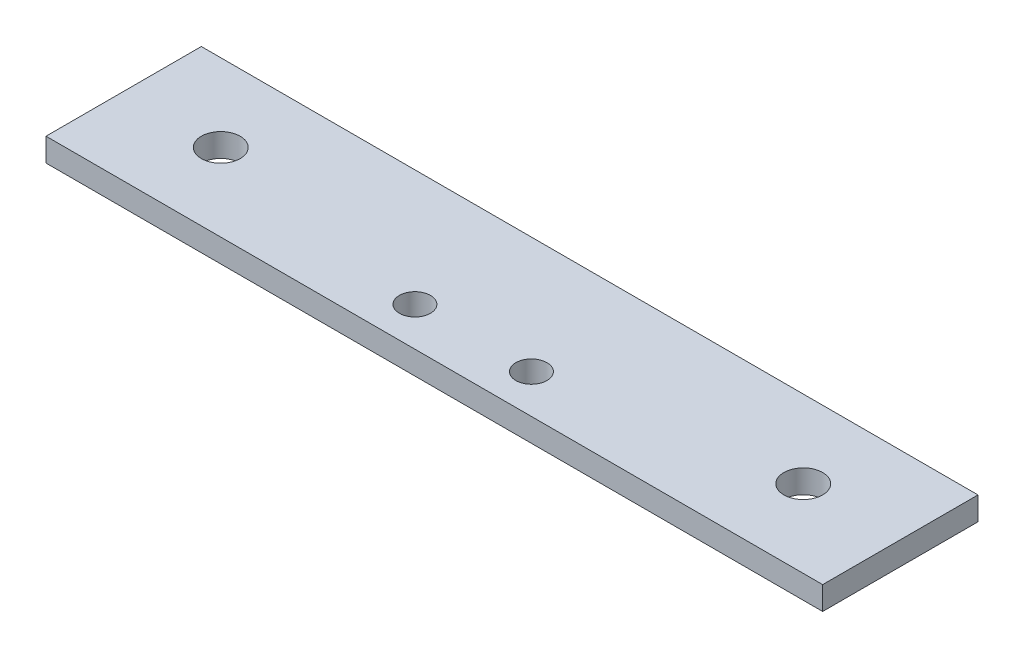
ISO-10303-21;
HEADER;
FILE_DESCRIPTION(('STEP AP214'),'2;1');
FILE_NAME('part.step','',(''),(''),'','','');
FILE_SCHEMA(('AUTOMOTIVE_DESIGN { 1 0 10303 214 1 1 1 1 }'));
ENDSEC;
DATA;
#1=APPLICATION_CONTEXT('core data for automotive mechanical design processes');
#2=APPLICATION_PROTOCOL_DEFINITION('international standard','automotive_design',2000,#1);
#3=PRODUCT_CONTEXT('',#1,'mechanical');
#4=PRODUCT('Part','Part','',(#3));
#5=PRODUCT_RELATED_PRODUCT_CATEGORY('part','',(#4));
#6=PRODUCT_DEFINITION_FORMATION('','',#4);
#7=PRODUCT_DEFINITION_CONTEXT('part definition',#1,'design');
#8=PRODUCT_DEFINITION('design','',#6,#7);
#9=PRODUCT_DEFINITION_SHAPE('','',#8);
#10=(LENGTH_UNIT() NAMED_UNIT(*) SI_UNIT(.MILLI.,.METRE.));
#11=(NAMED_UNIT(*) PLANE_ANGLE_UNIT() SI_UNIT($,.RADIAN.));
#12=(NAMED_UNIT(*) SI_UNIT($,.STERADIAN.) SOLID_ANGLE_UNIT());
#13=UNCERTAINTY_MEASURE_WITH_UNIT(LENGTH_MEASURE(1.E-05),#10,'distance_accuracy_value','');
#14=(GEOMETRIC_REPRESENTATION_CONTEXT(3) GLOBAL_UNCERTAINTY_ASSIGNED_CONTEXT((#13)) GLOBAL_UNIT_ASSIGNED_CONTEXT((#10,
#11,#12)) REPRESENTATION_CONTEXT('',''));
#15=CARTESIAN_POINT('',(0.,0.,0.));
#16=DIRECTION('',(0.,0.,1.));
#17=DIRECTION('',(1.,0.,0.));
#18=AXIS2_PLACEMENT_3D('',#15,#16,#17);
#19=CARTESIAN_POINT('',(0.,3.,0.));
#20=DIRECTION('',(0.,1.,0.));
#21=DIRECTION('',(0.,0.,1.));
#22=AXIS2_PLACEMENT_3D('',#19,#20,#21);
#23=PLANE('',#22);
#24=CARTESIAN_POINT('',(-7.50000000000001,3.,5.));
#25=DIRECTION('',(0.,1.,0.));
#26=DIRECTION('',(0.,0.,1.));
#27=AXIS2_PLACEMENT_3D('',#24,#25,#26);
#28=CIRCLE('',#27,2.);
#29=CARTESIAN_POINT('',(-7.50000000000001,3.,7.));
#30=VERTEX_POINT('',#29);
#31=EDGE_CURVE('E142',#30,#30,#28,.T.);
#32=ORIENTED_EDGE('',*,*,#31,.F.);
#33=EDGE_LOOP('',(#32));
#34=FACE_BOUND('',#33,.T.);
#35=CARTESIAN_POINT('',(-37.5,3.,0.));
#36=DIRECTION('',(0.,1.,0.));
#37=DIRECTION('',(0.,0.,1.));
#38=AXIS2_PLACEMENT_3D('',#35,#36,#37);
#39=CIRCLE('',#38,2.5);
#40=CARTESIAN_POINT('',(-37.5,3.,2.5));
#41=VERTEX_POINT('',#40);
#42=EDGE_CURVE('E112',#41,#41,#39,.T.);
#43=ORIENTED_EDGE('',*,*,#42,.F.);
#44=EDGE_LOOP('',(#43));
#45=FACE_BOUND('',#44,.T.);
#46=DIRECTION('',(0.,0.,-1.));
#47=VECTOR('',#46,1.);
#48=CARTESIAN_POINT('',(50.,3.,-10.));
#49=LINE('',#48,#47);
#50=CARTESIAN_POINT('',(50.,3.,10.));
#51=VERTEX_POINT('',#50);
#52=CARTESIAN_POINT('',(50.,3.,-10.));
#53=VERTEX_POINT('',#52);
#54=EDGE_CURVE('E92',#51,#53,#49,.T.);
#55=ORIENTED_EDGE('',*,*,#54,.T.);
#56=DIRECTION('',(-1.,0.,0.));
#57=VECTOR('',#56,1.);
#58=CARTESIAN_POINT('',(-50.,3.,-10.));
#59=LINE('',#58,#57);
#60=CARTESIAN_POINT('',(-50.,3.,-10.));
#61=VERTEX_POINT('',#60);
#62=EDGE_CURVE('E87',#53,#61,#59,.T.);
#63=ORIENTED_EDGE('',*,*,#62,.T.);
#64=DIRECTION('',(0.,0.,1.));
#65=VECTOR('',#64,1.);
#66=CARTESIAN_POINT('',(-50.,3.,-10.));
#67=LINE('',#66,#65);
#68=CARTESIAN_POINT('',(-50.,3.,10.));
#69=VERTEX_POINT('',#68);
#70=EDGE_CURVE('E90',#61,#69,#67,.T.);
#71=ORIENTED_EDGE('',*,*,#70,.T.);
#72=DIRECTION('',(1.,0.,0.));
#73=VECTOR('',#72,1.);
#74=CARTESIAN_POINT('',(-50.,3.,10.));
#75=LINE('',#74,#73);
#76=EDGE_CURVE('E57',#69,#51,#75,.T.);
#77=ORIENTED_EDGE('',*,*,#76,.T.);
#78=EDGE_LOOP('',(#55,#63,#71,#77));
#79=FACE_BOUND('',#78,.T.);
#80=CARTESIAN_POINT('',(37.5,3.,0.));
#81=DIRECTION('',(0.,1.,0.));
#82=DIRECTION('',(0.,0.,1.));
#83=AXIS2_PLACEMENT_3D('',#80,#81,#82);
#84=CIRCLE('',#83,2.5);
#85=CARTESIAN_POINT('',(37.5,3.,2.49999999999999));
#86=VERTEX_POINT('',#85);
#87=EDGE_CURVE('E134',#86,#86,#84,.T.);
#88=ORIENTED_EDGE('',*,*,#87,.F.);
#89=EDGE_LOOP('',(#88));
#90=FACE_BOUND('',#89,.T.);
#91=CARTESIAN_POINT('',(7.49999999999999,3.,5.));
#92=DIRECTION('',(0.,1.,0.));
#93=DIRECTION('',(0.,0.,1.));
#94=AXIS2_PLACEMENT_3D('',#91,#92,#93);
#95=CIRCLE('',#94,2.);
#96=CARTESIAN_POINT('',(7.49999999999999,3.,7.));
#97=VERTEX_POINT('',#96);
#98=EDGE_CURVE('E150',#97,#97,#95,.T.);
#99=ORIENTED_EDGE('',*,*,#98,.F.);
#100=EDGE_LOOP('',(#99));
#101=FACE_BOUND('',#100,.T.);
#102=ADVANCED_FACE('F39',(#34,#45,#79,#90,#101),#23,.T.);
#103=CARTESIAN_POINT('',(0.,0.,0.));
#104=DIRECTION('',(0.,1.,0.));
#105=DIRECTION('',(0.,0.,1.));
#106=AXIS2_PLACEMENT_3D('',#103,#104,#105);
#107=PLANE('',#106);
#108=DIRECTION('',(0.,0.,-1.));
#109=VECTOR('',#108,1.);
#110=CARTESIAN_POINT('',(50.,0.,-10.));
#111=LINE('',#110,#109);
#112=CARTESIAN_POINT('',(50.,0.,10.));
#113=VERTEX_POINT('',#112);
#114=CARTESIAN_POINT('',(50.,0.,-10.));
#115=VERTEX_POINT('',#114);
#116=EDGE_CURVE('E108',#113,#115,#111,.T.);
#117=ORIENTED_EDGE('',*,*,#116,.F.);
#118=DIRECTION('',(1.,0.,0.));
#119=VECTOR('',#118,1.);
#120=CARTESIAN_POINT('',(-50.,0.,10.));
#121=LINE('',#120,#119);
#122=CARTESIAN_POINT('',(-50.,0.,10.));
#123=VERTEX_POINT('',#122);
#124=EDGE_CURVE('E80',#123,#113,#121,.T.);
#125=ORIENTED_EDGE('',*,*,#124,.F.);
#126=DIRECTION('',(0.,0.,1.));
#127=VECTOR('',#126,1.);
#128=CARTESIAN_POINT('',(-50.,0.,-10.));
#129=LINE('',#128,#127);
#130=CARTESIAN_POINT('',(-50.,0.,-10.));
#131=VERTEX_POINT('',#130);
#132=EDGE_CURVE('E74',#131,#123,#129,.T.);
#133=ORIENTED_EDGE('',*,*,#132,.F.);
#134=DIRECTION('',(-1.,0.,0.));
#135=VECTOR('',#134,1.);
#136=CARTESIAN_POINT('',(-50.,0.,-10.));
#137=LINE('',#136,#135);
#138=EDGE_CURVE('E97',#115,#131,#137,.T.);
#139=ORIENTED_EDGE('',*,*,#138,.F.);
#140=EDGE_LOOP('',(#117,#125,#133,#139));
#141=FACE_BOUND('',#140,.T.);
#142=CARTESIAN_POINT('',(-37.5,0.,0.));
#143=DIRECTION('',(0.,1.,0.));
#144=DIRECTION('',(0.,0.,1.));
#145=AXIS2_PLACEMENT_3D('',#142,#143,#144);
#146=CIRCLE('',#145,2.5);
#147=CARTESIAN_POINT('',(-37.5,0.,2.5));
#148=VERTEX_POINT('',#147);
#149=EDGE_CURVE('E130',#148,#148,#146,.T.);
#150=ORIENTED_EDGE('',*,*,#149,.T.);
#151=EDGE_LOOP('',(#150));
#152=FACE_BOUND('',#151,.T.);
#153=CARTESIAN_POINT('',(37.5,0.,0.));
#154=DIRECTION('',(0.,1.,0.));
#155=DIRECTION('',(0.,0.,1.));
#156=AXIS2_PLACEMENT_3D('',#153,#154,#155);
#157=CIRCLE('',#156,2.5);
#158=CARTESIAN_POINT('',(37.5,0.,2.49999999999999));
#159=VERTEX_POINT('',#158);
#160=EDGE_CURVE('E138',#159,#159,#157,.T.);
#161=ORIENTED_EDGE('',*,*,#160,.T.);
#162=EDGE_LOOP('',(#161));
#163=FACE_BOUND('',#162,.T.);
#164=CARTESIAN_POINT('',(-7.50000000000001,0.,5.));
#165=DIRECTION('',(0.,1.,0.));
#166=DIRECTION('',(0.,0.,1.));
#167=AXIS2_PLACEMENT_3D('',#164,#165,#166);
#168=CIRCLE('',#167,2.);
#169=CARTESIAN_POINT('',(-7.50000000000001,0.,7.));
#170=VERTEX_POINT('',#169);
#171=EDGE_CURVE('E146',#170,#170,#168,.T.);
#172=ORIENTED_EDGE('',*,*,#171,.T.);
#173=EDGE_LOOP('',(#172));
#174=FACE_BOUND('',#173,.T.);
#175=CARTESIAN_POINT('',(7.49999999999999,0.,5.));
#176=DIRECTION('',(0.,1.,0.));
#177=DIRECTION('',(0.,0.,1.));
#178=AXIS2_PLACEMENT_3D('',#175,#176,#177);
#179=CIRCLE('',#178,2.);
#180=CARTESIAN_POINT('',(7.49999999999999,0.,7.));
#181=VERTEX_POINT('',#180);
#182=EDGE_CURVE('E154',#181,#181,#179,.T.);
#183=ORIENTED_EDGE('',*,*,#182,.T.);
#184=EDGE_LOOP('',(#183));
#185=FACE_BOUND('',#184,.T.);
#186=ADVANCED_FACE('F125',(#141,#152,#163,#174,#185),#107,.F.);
#187=CARTESIAN_POINT('',(50.,3.,-10.));
#188=DIRECTION('',(-1.,0.,0.));
#189=DIRECTION('',(0.,0.,1.));
#190=AXIS2_PLACEMENT_3D('',#187,#188,#189);
#191=PLANE('',#190);
#192=ORIENTED_EDGE('',*,*,#116,.T.);
#193=DIRECTION('',(0.,-1.,0.));
#194=VECTOR('',#193,1.);
#195=CARTESIAN_POINT('',(50.,3.,-10.));
#196=LINE('',#195,#194);
#197=EDGE_CURVE('E11',#53,#115,#196,.T.);
#198=ORIENTED_EDGE('',*,*,#197,.F.);
#199=ORIENTED_EDGE('',*,*,#54,.F.);
#200=DIRECTION('',(0.,-1.,0.));
#201=VECTOR('',#200,1.);
#202=CARTESIAN_POINT('',(50.,3.,10.));
#203=LINE('',#202,#201);
#204=EDGE_CURVE('E104',#51,#113,#203,.T.);
#205=ORIENTED_EDGE('',*,*,#204,.T.);
#206=EDGE_LOOP('',(#192,#198,#199,#205));
#207=FACE_BOUND('',#206,.T.);
#208=ADVANCED_FACE('F41',(#207),#191,.F.);
#209=CARTESIAN_POINT('',(-50.,3.,-10.));
#210=DIRECTION('',(0.,0.,1.));
#211=DIRECTION('',(1.,0.,0.));
#212=AXIS2_PLACEMENT_3D('',#209,#210,#211);
#213=PLANE('',#212);
#214=ORIENTED_EDGE('',*,*,#138,.T.);
#215=DIRECTION('',(0.,-1.,0.));
#216=VECTOR('',#215,1.);
#217=CARTESIAN_POINT('',(-50.,3.,-10.));
#218=LINE('',#217,#216);
#219=EDGE_CURVE('E49',#61,#131,#218,.T.);
#220=ORIENTED_EDGE('',*,*,#219,.F.);
#221=ORIENTED_EDGE('',*,*,#62,.F.);
#222=ORIENTED_EDGE('',*,*,#197,.T.);
#223=EDGE_LOOP('',(#214,#220,#221,#222));
#224=FACE_BOUND('',#223,.T.);
#225=ADVANCED_FACE('F96',(#224),#213,.F.);
#226=CARTESIAN_POINT('',(-50.,3.,-10.));
#227=DIRECTION('',(1.,0.,0.));
#228=DIRECTION('',(0.,0.,-1.));
#229=AXIS2_PLACEMENT_3D('',#226,#227,#228);
#230=PLANE('',#229);
#231=ORIENTED_EDGE('',*,*,#132,.T.);
#232=DIRECTION('',(0.,-1.,0.));
#233=VECTOR('',#232,1.);
#234=CARTESIAN_POINT('',(-50.,3.,10.));
#235=LINE('',#234,#233);
#236=EDGE_CURVE('E99',#69,#123,#235,.T.);
#237=ORIENTED_EDGE('',*,*,#236,.F.);
#238=ORIENTED_EDGE('',*,*,#70,.F.);
#239=ORIENTED_EDGE('',*,*,#219,.T.);
#240=EDGE_LOOP('',(#231,#237,#238,#239));
#241=FACE_BOUND('',#240,.T.);
#242=ADVANCED_FACE('F100',(#241),#230,.F.);
#243=CARTESIAN_POINT('',(-50.,3.,10.));
#244=DIRECTION('',(0.,0.,-1.));
#245=DIRECTION('',(-1.,0.,0.));
#246=AXIS2_PLACEMENT_3D('',#243,#244,#245);
#247=PLANE('',#246);
#248=ORIENTED_EDGE('',*,*,#124,.T.);
#249=ORIENTED_EDGE('',*,*,#204,.F.);
#250=ORIENTED_EDGE('',*,*,#76,.F.);
#251=ORIENTED_EDGE('',*,*,#236,.T.);
#252=EDGE_LOOP('',(#248,#249,#250,#251));
#253=FACE_BOUND('',#252,.T.);
#254=ADVANCED_FACE('F122',(#253),#247,.F.);
#255=CARTESIAN_POINT('',(-37.5,3.,0.));
#256=DIRECTION('',(0.,-1.,0.));
#257=DIRECTION('',(0.,0.,-1.));
#258=AXIS2_PLACEMENT_3D('',#255,#256,#257);
#259=CYLINDRICAL_SURFACE('',#258,2.5);
#260=ORIENTED_EDGE('',*,*,#42,.T.);
#261=EDGE_LOOP('',(#260));
#262=FACE_BOUND('',#261,.T.);
#263=ORIENTED_EDGE('',*,*,#149,.F.);
#264=EDGE_LOOP('',(#263));
#265=FACE_BOUND('',#264,.T.);
#266=ADVANCED_FACE('F175',(#262,#265),#259,.F.);
#267=CARTESIAN_POINT('',(37.5,3.,0.));
#268=DIRECTION('',(0.,-1.,0.));
#269=DIRECTION('',(0.,0.,-1.));
#270=AXIS2_PLACEMENT_3D('',#267,#268,#269);
#271=CYLINDRICAL_SURFACE('',#270,2.5);
#272=ORIENTED_EDGE('',*,*,#87,.T.);
#273=EDGE_LOOP('',(#272));
#274=FACE_BOUND('',#273,.T.);
#275=ORIENTED_EDGE('',*,*,#160,.F.);
#276=EDGE_LOOP('',(#275));
#277=FACE_BOUND('',#276,.T.);
#278=ADVANCED_FACE('F221',(#274,#277),#271,.F.);
#279=CARTESIAN_POINT('',(-7.50000000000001,3.,5.));
#280=DIRECTION('',(0.,-1.,0.));
#281=DIRECTION('',(0.,0.,-1.));
#282=AXIS2_PLACEMENT_3D('',#279,#280,#281);
#283=CYLINDRICAL_SURFACE('',#282,2.);
#284=ORIENTED_EDGE('',*,*,#31,.T.);
#285=EDGE_LOOP('',(#284));
#286=FACE_BOUND('',#285,.T.);
#287=ORIENTED_EDGE('',*,*,#171,.F.);
#288=EDGE_LOOP('',(#287));
#289=FACE_BOUND('',#288,.T.);
#290=ADVANCED_FACE('F229',(#286,#289),#283,.F.);
#291=CARTESIAN_POINT('',(7.49999999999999,3.,5.));
#292=DIRECTION('',(0.,-1.,0.));
#293=DIRECTION('',(0.,0.,-1.));
#294=AXIS2_PLACEMENT_3D('',#291,#292,#293);
#295=CYLINDRICAL_SURFACE('',#294,2.);
#296=ORIENTED_EDGE('',*,*,#98,.T.);
#297=EDGE_LOOP('',(#296));
#298=FACE_BOUND('',#297,.T.);
#299=ORIENTED_EDGE('',*,*,#182,.F.);
#300=EDGE_LOOP('',(#299));
#301=FACE_BOUND('',#300,.T.);
#302=ADVANCED_FACE('F162',(#298,#301),#295,.F.);
#303=CLOSED_SHELL('',(#102,#186,#208,#225,#242,#254,#266,#278,#290,#302));
#304=MANIFOLD_SOLID_BREP('B2',#303);
#305=ADVANCED_BREP_SHAPE_REPRESENTATION('',(#18,#304),#14);
#306=SHAPE_DEFINITION_REPRESENTATION(#9,#305);
ENDSEC;
END-ISO-10303-21;
